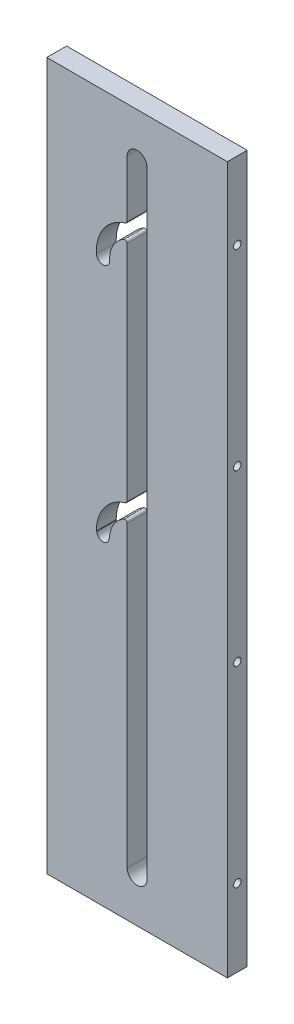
ISO-10303-21;
HEADER;
FILE_DESCRIPTION(('STEP AP214'),'2;1');
FILE_NAME('part.step','',(''),(''),'','','');
FILE_SCHEMA(('AUTOMOTIVE_DESIGN { 1 0 10303 214 1 1 1 1 }'));
ENDSEC;
DATA;
#1=APPLICATION_CONTEXT('core data for automotive mechanical design processes');
#2=APPLICATION_PROTOCOL_DEFINITION('international standard','automotive_design',2000,#1);
#3=PRODUCT_CONTEXT('',#1,'mechanical');
#4=PRODUCT('Part','Part','',(#3));
#5=PRODUCT_RELATED_PRODUCT_CATEGORY('part','',(#4));
#6=PRODUCT_DEFINITION_FORMATION('','',#4);
#7=PRODUCT_DEFINITION_CONTEXT('part definition',#1,'design');
#8=PRODUCT_DEFINITION('design','',#6,#7);
#9=PRODUCT_DEFINITION_SHAPE('','',#8);
#10=(LENGTH_UNIT() NAMED_UNIT(*) SI_UNIT(.MILLI.,.METRE.));
#11=(NAMED_UNIT(*) PLANE_ANGLE_UNIT() SI_UNIT($,.RADIAN.));
#12=(NAMED_UNIT(*) SI_UNIT($,.STERADIAN.) SOLID_ANGLE_UNIT());
#13=UNCERTAINTY_MEASURE_WITH_UNIT(LENGTH_MEASURE(1.E-05),#10,'distance_accuracy_value','');
#14=(GEOMETRIC_REPRESENTATION_CONTEXT(3) GLOBAL_UNCERTAINTY_ASSIGNED_CONTEXT((#13)) GLOBAL_UNIT_ASSIGNED_CONTEXT((#10,
#11,#12)) REPRESENTATION_CONTEXT('',''));
#15=CARTESIAN_POINT('',(0.,0.,0.));
#16=DIRECTION('',(0.,0.,1.));
#17=DIRECTION('',(1.,0.,0.));
#18=AXIS2_PLACEMENT_3D('',#15,#16,#17);
#19=CARTESIAN_POINT('',(-89.4999999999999,29.5,150.));
#20=DIRECTION('',(-1.,0.,0.));
#21=DIRECTION('',(0.,1.,0.));
#22=AXIS2_PLACEMENT_3D('',#19,#20,#21);
#23=PLANE('',#22);
#24=DIRECTION('',(0.,1.,0.));
#25=VECTOR('',#24,1.);
#26=CARTESIAN_POINT('',(-89.4999999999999,29.5,150.));
#27=LINE('',#26,#25);
#28=CARTESIAN_POINT('',(-89.4999999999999,283.70828693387,150.));
#29=VERTEX_POINT('',#28);
#30=CARTESIAN_POINT('',(-89.4999999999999,309.5,150.));
#31=VERTEX_POINT('',#30);
#32=EDGE_CURVE('E274',#29,#31,#27,.T.);
#33=ORIENTED_EDGE('',*,*,#32,.F.);
#34=DIRECTION('',(0.,0.,1.));
#35=VECTOR('',#34,1.);
#36=CARTESIAN_POINT('',(-89.4999999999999,283.70828693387,141.));
#37=LINE('',#36,#35);
#38=CARTESIAN_POINT('',(-89.4999999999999,283.70828693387,141.));
#39=VERTEX_POINT('',#38);
#40=EDGE_CURVE('E12',#29,#39,#37,.F.);
#41=ORIENTED_EDGE('',*,*,#40,.T.);
#42=DIRECTION('',(0.,1.,0.));
#43=VECTOR('',#42,1.);
#44=CARTESIAN_POINT('',(-89.5,29.5,141.));
#45=LINE('',#44,#43);
#46=CARTESIAN_POINT('',(-89.4999999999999,309.5,141.));
#47=VERTEX_POINT('',#46);
#48=EDGE_CURVE('E260',#39,#47,#45,.T.);
#49=ORIENTED_EDGE('',*,*,#48,.T.);
#50=DIRECTION('',(0.,0.,-1.));
#51=VECTOR('',#50,1.);
#52=CARTESIAN_POINT('',(-89.4999999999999,309.5,150.));
#53=LINE('',#52,#51);
#54=EDGE_CURVE('E240',#31,#47,#53,.T.);
#55=ORIENTED_EDGE('',*,*,#54,.F.);
#56=EDGE_LOOP('',(#33,#41,#49,#55));
#57=FACE_BOUND('',#56,.T.);
#58=ADVANCED_FACE('F37',(#57),#23,.F.);
#59=CARTESIAN_POINT('',(-103.5,155.,150.));
#60=DIRECTION('',(0.,1.,0.));
#61=DIRECTION('',(0.,0.,-1.));
#62=AXIS2_PLACEMENT_3D('',#59,#60,#61);
#63=PLANE('',#62);
#64=DIRECTION('',(1.,0.,0.));
#65=VECTOR('',#64,1.);
#66=CARTESIAN_POINT('',(-103.5,155.,141.));
#67=LINE('',#66,#65);
#68=CARTESIAN_POINT('',(-97.7499999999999,155.,141.));
#69=VERTEX_POINT('',#68);
#70=CARTESIAN_POINT('',(-97.5,155.,141.));
#71=VERTEX_POINT('',#70);
#72=EDGE_CURVE('E290',#69,#71,#67,.T.);
#73=ORIENTED_EDGE('',*,*,#72,.F.);
#74=DIRECTION('',(0.,0.,-1.));
#75=VECTOR('',#74,1.);
#76=CARTESIAN_POINT('',(-97.7499999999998,155.,150.));
#77=LINE('',#76,#75);
#78=CARTESIAN_POINT('',(-97.7499999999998,155.,150.));
#79=VERTEX_POINT('',#78);
#80=EDGE_CURVE('E194',#69,#79,#77,.F.);
#81=ORIENTED_EDGE('',*,*,#80,.T.);
#82=DIRECTION('',(1.,0.,0.));
#83=VECTOR('',#82,1.);
#84=CARTESIAN_POINT('',(-103.5,155.,150.));
#85=LINE('',#84,#83);
#86=CARTESIAN_POINT('',(-97.4999999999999,155.,150.));
#87=VERTEX_POINT('',#86);
#88=EDGE_CURVE('E300',#79,#87,#85,.T.);
#89=ORIENTED_EDGE('',*,*,#88,.T.);
#90=DIRECTION('',(0.,0.,-1.));
#91=VECTOR('',#90,1.);
#92=CARTESIAN_POINT('',(-97.4999999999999,155.,150.));
#93=LINE('',#92,#91);
#94=EDGE_CURVE('E277',#87,#71,#93,.T.);
#95=ORIENTED_EDGE('',*,*,#94,.T.);
#96=EDGE_LOOP('',(#73,#81,#89,#95));
#97=FACE_BOUND('',#96,.T.);
#98=ADVANCED_FACE('F484',(#97),#63,.T.);
#99=CARTESIAN_POINT('',(-103.5,155.,150.));
#100=VERTEX_POINT('',#99);
#101=CARTESIAN_POINT('',(-103.25,155.,150.));
#102=VERTEX_POINT('',#101);
#103=EDGE_CURVE('E297',#100,#102,#85,.T.);
#104=ORIENTED_EDGE('',*,*,#103,.T.);
#105=DIRECTION('',(0.,0.,-1.));
#106=VECTOR('',#105,1.);
#107=CARTESIAN_POINT('',(-103.25,155.,150.));
#108=LINE('',#107,#106);
#109=CARTESIAN_POINT('',(-103.25,155.,141.));
#110=VERTEX_POINT('',#109);
#111=EDGE_CURVE('E197',#102,#110,#108,.T.);
#112=ORIENTED_EDGE('',*,*,#111,.T.);
#113=CARTESIAN_POINT('',(-103.5,155.,141.));
#114=VERTEX_POINT('',#113);
#115=EDGE_CURVE('E287',#114,#110,#67,.T.);
#116=ORIENTED_EDGE('',*,*,#115,.F.);
#117=DIRECTION('',(0.,0.,-1.));
#118=VECTOR('',#117,1.);
#119=CARTESIAN_POINT('',(-103.5,155.,150.));
#120=LINE('',#119,#118);
#121=EDGE_CURVE('E264',#100,#114,#120,.T.);
#122=ORIENTED_EDGE('',*,*,#121,.F.);
#123=EDGE_LOOP('',(#104,#112,#116,#122));
#124=FACE_BOUND('',#123,.T.);
#125=ADVANCED_FACE('F472',(#124),#63,.T.);
#126=CARTESIAN_POINT('',(-89.5,173.70828693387,141.));
#127=VERTEX_POINT('',#126);
#128=CARTESIAN_POINT('',(-89.4999999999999,275.099504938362,141.));
#129=VERTEX_POINT('',#128);
#130=EDGE_CURVE('E259',#127,#129,#45,.T.);
#131=ORIENTED_EDGE('',*,*,#130,.T.);
#132=DIRECTION('',(0.,0.,-1.));
#133=VECTOR('',#132,1.);
#134=CARTESIAN_POINT('',(-89.4999999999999,275.099504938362,150.));
#135=LINE('',#134,#133);
#136=CARTESIAN_POINT('',(-89.4999999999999,275.099504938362,150.));
#137=VERTEX_POINT('',#136);
#138=EDGE_CURVE('E161',#129,#137,#135,.F.);
#139=ORIENTED_EDGE('',*,*,#138,.T.);
#140=CARTESIAN_POINT('',(-89.4999999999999,173.70828693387,150.));
#141=VERTEX_POINT('',#140);
#142=EDGE_CURVE('E273',#141,#137,#27,.T.);
#143=ORIENTED_EDGE('',*,*,#142,.F.);
#144=DIRECTION('',(0.,0.,1.));
#145=VECTOR('',#144,1.);
#146=CARTESIAN_POINT('',(-89.5,173.70828693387,141.));
#147=LINE('',#146,#145);
#148=EDGE_CURVE('E182',#141,#127,#147,.F.);
#149=ORIENTED_EDGE('',*,*,#148,.T.);
#150=EDGE_LOOP('',(#131,#139,#143,#149));
#151=FACE_BOUND('',#150,.T.);
#152=ADVANCED_FACE('F365',(#151),#23,.F.);
#153=CARTESIAN_POINT('',(-43.9999999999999,9.,150.));
#154=DIRECTION('',(1.,0.,0.));
#155=DIRECTION('',(0.,0.,-1.));
#156=AXIS2_PLACEMENT_3D('',#153,#154,#155);
#157=PLANE('',#156);
#158=CARTESIAN_POINT('',(-44.,295.,145.5));
#159=DIRECTION('',(1.,0.,0.));
#160=DIRECTION('',(0.,0.,-1.));
#161=AXIS2_PLACEMENT_3D('',#158,#159,#160);
#162=CIRCLE('',#161,1.69999999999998);
#163=CARTESIAN_POINT('',(-44.,295.,143.8));
#164=VERTEX_POINT('',#163);
#165=EDGE_CURVE('E94',#164,#164,#162,.T.);
#166=ORIENTED_EDGE('',*,*,#165,.F.);
#167=EDGE_LOOP('',(#166));
#168=FACE_BOUND('',#167,.T.);
#169=CARTESIAN_POINT('',(-44.,208.,145.5));
#170=DIRECTION('',(1.,0.,0.));
#171=DIRECTION('',(0.,0.,-1.));
#172=AXIS2_PLACEMENT_3D('',#169,#170,#171);
#173=CIRCLE('',#172,1.70000000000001);
#174=CARTESIAN_POINT('',(-44.,208.,143.8));
#175=VERTEX_POINT('',#174);
#176=EDGE_CURVE('E93',#175,#175,#173,.T.);
#177=ORIENTED_EDGE('',*,*,#176,.F.);
#178=EDGE_LOOP('',(#177));
#179=FACE_BOUND('',#178,.T.);
#180=CARTESIAN_POINT('',(-44.,131.,145.5));
#181=DIRECTION('',(1.,0.,0.));
#182=DIRECTION('',(0.,0.,-1.));
#183=AXIS2_PLACEMENT_3D('',#180,#181,#182);
#184=CIRCLE('',#183,1.69999999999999);
#185=CARTESIAN_POINT('',(-44.,131.,143.8));
#186=VERTEX_POINT('',#185);
#187=EDGE_CURVE('E126',#186,#186,#184,.T.);
#188=ORIENTED_EDGE('',*,*,#187,.F.);
#189=EDGE_LOOP('',(#188));
#190=FACE_BOUND('',#189,.T.);
#191=CARTESIAN_POINT('',(-44.,44.,145.5));
#192=DIRECTION('',(1.,0.,0.));
#193=DIRECTION('',(0.,0.,-1.));
#194=AXIS2_PLACEMENT_3D('',#191,#192,#193);
#195=CIRCLE('',#194,1.69999999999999);
#196=CARTESIAN_POINT('',(-44.,44.,143.8));
#197=VERTEX_POINT('',#196);
#198=EDGE_CURVE('E125',#197,#197,#195,.T.);
#199=ORIENTED_EDGE('',*,*,#198,.F.);
#200=EDGE_LOOP('',(#199));
#201=FACE_BOUND('',#200,.T.);
#202=DIRECTION('',(0.,-1.,0.));
#203=VECTOR('',#202,1.);
#204=CARTESIAN_POINT('',(-44.,9.,141.));
#205=LINE('',#204,#203);
#206=CARTESIAN_POINT('',(-44.,330.,141.));
#207=VERTEX_POINT('',#206);
#208=CARTESIAN_POINT('',(-44.,9.,141.));
#209=VERTEX_POINT('',#208);
#210=EDGE_CURVE('E223',#207,#209,#205,.T.);
#211=ORIENTED_EDGE('',*,*,#210,.F.);
#212=DIRECTION('',(0.,0.,-1.));
#213=VECTOR('',#212,1.);
#214=CARTESIAN_POINT('',(-43.9999999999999,330.,150.));
#215=LINE('',#214,#213);
#216=CARTESIAN_POINT('',(-43.9999999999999,330.,150.));
#217=VERTEX_POINT('',#216);
#218=EDGE_CURVE('E200',#217,#207,#215,.T.);
#219=ORIENTED_EDGE('',*,*,#218,.F.);
#220=DIRECTION('',(0.,-1.,0.));
#221=VECTOR('',#220,1.);
#222=CARTESIAN_POINT('',(-43.9999999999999,9.,150.));
#223=LINE('',#222,#221);
#224=CARTESIAN_POINT('',(-43.9999999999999,9.,150.));
#225=VERTEX_POINT('',#224);
#226=EDGE_CURVE('E216',#217,#225,#223,.T.);
#227=ORIENTED_EDGE('',*,*,#226,.T.);
#228=DIRECTION('',(0.,0.,-1.));
#229=VECTOR('',#228,1.);
#230=CARTESIAN_POINT('',(-43.9999999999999,9.,150.));
#231=LINE('',#230,#229);
#232=EDGE_CURVE('E201',#225,#209,#231,.T.);
#233=ORIENTED_EDGE('',*,*,#232,.T.);
#234=EDGE_LOOP('',(#211,#219,#227,#233));
#235=FACE_BOUND('',#234,.T.);
#236=ADVANCED_FACE('F521',(#168,#179,#190,#201,#235),#157,.T.);
#237=CARTESIAN_POINT('',(-43.9999999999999,330.,150.));
#238=DIRECTION('',(0.,1.,0.));
#239=DIRECTION('',(0.,0.,-1.));
#240=AXIS2_PLACEMENT_3D('',#237,#238,#239);
#241=PLANE('',#240);
#242=DIRECTION('',(1.,0.,0.));
#243=VECTOR('',#242,1.);
#244=CARTESIAN_POINT('',(-44.,330.,141.));
#245=LINE('',#244,#243);
#246=CARTESIAN_POINT('',(-126.,330.,141.));
#247=VERTEX_POINT('',#246);
#248=EDGE_CURVE('E213',#247,#207,#245,.T.);
#249=ORIENTED_EDGE('',*,*,#248,.F.);
#250=DIRECTION('',(0.,0.,-1.));
#251=VECTOR('',#250,1.);
#252=CARTESIAN_POINT('',(-126.,330.,150.));
#253=LINE('',#252,#251);
#254=CARTESIAN_POINT('',(-126.,330.,150.));
#255=VERTEX_POINT('',#254);
#256=EDGE_CURVE('E208',#255,#247,#253,.T.);
#257=ORIENTED_EDGE('',*,*,#256,.F.);
#258=DIRECTION('',(1.,0.,0.));
#259=VECTOR('',#258,1.);
#260=CARTESIAN_POINT('',(-43.9999999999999,330.,150.));
#261=LINE('',#260,#259);
#262=EDGE_CURVE('E205',#255,#217,#261,.T.);
#263=ORIENTED_EDGE('',*,*,#262,.T.);
#264=ORIENTED_EDGE('',*,*,#218,.T.);
#265=EDGE_LOOP('',(#249,#257,#263,#264));
#266=FACE_BOUND('',#265,.T.);
#267=ADVANCED_FACE('F585',(#266),#241,.T.);
#268=CARTESIAN_POINT('',(-126.,9.,150.));
#269=DIRECTION('',(-1.,0.,0.));
#270=DIRECTION('',(0.,0.,1.));
#271=AXIS2_PLACEMENT_3D('',#268,#269,#270);
#272=PLANE('',#271);
#273=CARTESIAN_POINT('',(-126.,295.,145.5));
#274=DIRECTION('',(-1.,0.,0.));
#275=DIRECTION('',(0.,0.,1.));
#276=AXIS2_PLACEMENT_3D('',#273,#274,#275);
#277=CIRCLE('',#276,1.69999999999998);
#278=CARTESIAN_POINT('',(-126.,295.,147.2));
#279=VERTEX_POINT('',#278);
#280=EDGE_CURVE('E119',#279,#279,#277,.T.);
#281=ORIENTED_EDGE('',*,*,#280,.F.);
#282=EDGE_LOOP('',(#281));
#283=FACE_BOUND('',#282,.T.);
#284=CARTESIAN_POINT('',(-126.,208.,145.5));
#285=DIRECTION('',(-1.,0.,0.));
#286=DIRECTION('',(0.,0.,1.));
#287=AXIS2_PLACEMENT_3D('',#284,#285,#286);
#288=CIRCLE('',#287,1.70000000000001);
#289=CARTESIAN_POINT('',(-126.,208.,147.2));
#290=VERTEX_POINT('',#289);
#291=EDGE_CURVE('E115',#290,#290,#288,.T.);
#292=ORIENTED_EDGE('',*,*,#291,.F.);
#293=EDGE_LOOP('',(#292));
#294=FACE_BOUND('',#293,.T.);
#295=CARTESIAN_POINT('',(-126.,131.,145.5));
#296=DIRECTION('',(-1.,0.,0.));
#297=DIRECTION('',(0.,0.,1.));
#298=AXIS2_PLACEMENT_3D('',#295,#296,#297);
#299=CIRCLE('',#298,1.69999999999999);
#300=CARTESIAN_POINT('',(-126.,131.,147.2));
#301=VERTEX_POINT('',#300);
#302=EDGE_CURVE('E111',#301,#301,#299,.T.);
#303=ORIENTED_EDGE('',*,*,#302,.F.);
#304=EDGE_LOOP('',(#303));
#305=FACE_BOUND('',#304,.T.);
#306=CARTESIAN_POINT('',(-126.,44.,145.5));
#307=DIRECTION('',(-1.,0.,0.));
#308=DIRECTION('',(0.,0.,1.));
#309=AXIS2_PLACEMENT_3D('',#306,#307,#308);
#310=CIRCLE('',#309,1.69999999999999);
#311=CARTESIAN_POINT('',(-126.,44.,147.2));
#312=VERTEX_POINT('',#311);
#313=EDGE_CURVE('E104',#312,#312,#310,.T.);
#314=ORIENTED_EDGE('',*,*,#313,.F.);
#315=EDGE_LOOP('',(#314));
#316=FACE_BOUND('',#315,.T.);
#317=DIRECTION('',(0.,1.,0.));
#318=VECTOR('',#317,1.);
#319=CARTESIAN_POINT('',(-126.,9.,141.));
#320=LINE('',#319,#318);
#321=CARTESIAN_POINT('',(-126.,9.,141.));
#322=VERTEX_POINT('',#321);
#323=EDGE_CURVE('E217',#322,#247,#320,.T.);
#324=ORIENTED_EDGE('',*,*,#323,.F.);
#325=DIRECTION('',(0.,0.,-1.));
#326=VECTOR('',#325,1.);
#327=CARTESIAN_POINT('',(-126.,9.,150.));
#328=LINE('',#327,#326);
#329=CARTESIAN_POINT('',(-126.,9.,150.));
#330=VERTEX_POINT('',#329);
#331=EDGE_CURVE('E204',#330,#322,#328,.T.);
#332=ORIENTED_EDGE('',*,*,#331,.F.);
#333=DIRECTION('',(0.,1.,0.));
#334=VECTOR('',#333,1.);
#335=CARTESIAN_POINT('',(-126.,9.,150.));
#336=LINE('',#335,#334);
#337=EDGE_CURVE('E229',#330,#255,#336,.T.);
#338=ORIENTED_EDGE('',*,*,#337,.T.);
#339=ORIENTED_EDGE('',*,*,#256,.T.);
#340=EDGE_LOOP('',(#324,#332,#338,#339));
#341=FACE_BOUND('',#340,.T.);
#342=ADVANCED_FACE('F581',(#283,#294,#305,#316,#341),#272,.T.);
#343=CARTESIAN_POINT('',(-43.9999999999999,9.,150.));
#344=DIRECTION('',(0.,-1.,0.));
#345=DIRECTION('',(0.,0.,1.));
#346=AXIS2_PLACEMENT_3D('',#343,#344,#345);
#347=PLANE('',#346);
#348=DIRECTION('',(-1.,0.,0.));
#349=VECTOR('',#348,1.);
#350=CARTESIAN_POINT('',(-44.,9.,141.));
#351=LINE('',#350,#349);
#352=EDGE_CURVE('E220',#209,#322,#351,.T.);
#353=ORIENTED_EDGE('',*,*,#352,.F.);
#354=ORIENTED_EDGE('',*,*,#232,.F.);
#355=DIRECTION('',(-1.,0.,0.));
#356=VECTOR('',#355,1.);
#357=CARTESIAN_POINT('',(-43.9999999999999,9.,150.));
#358=LINE('',#357,#356);
#359=EDGE_CURVE('E232',#225,#330,#358,.T.);
#360=ORIENTED_EDGE('',*,*,#359,.T.);
#361=ORIENTED_EDGE('',*,*,#331,.T.);
#362=EDGE_LOOP('',(#353,#354,#360,#361));
#363=FACE_BOUND('',#362,.T.);
#364=ADVANCED_FACE('F584',(#363),#347,.T.);
#365=CARTESIAN_POINT('',(-170.,0.,150.000000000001));
#366=DIRECTION('',(0.,0.,1.));
#367=DIRECTION('',(1.,0.,0.));
#368=AXIS2_PLACEMENT_3D('',#365,#366,#367);
#369=PLANE('',#368);
#370=ORIENTED_EDGE('',*,*,#142,.T.);
#371=CARTESIAN_POINT('',(-90.4999999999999,275.099504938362,150.));
#372=DIRECTION('',(0.,0.,1.));
#373=DIRECTION('',(1.,0.,0.));
#374=AXIS2_PLACEMENT_3D('',#371,#372,#373);
#375=CIRCLE('',#374,1.);
#376=CARTESIAN_POINT('',(-90.9782608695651,275.977722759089,150.));
#377=VERTEX_POINT('',#376);
#378=EDGE_CURVE('E155',#137,#377,#375,.T.);
#379=ORIENTED_EDGE('',*,*,#378,.T.);
#380=CARTESIAN_POINT('',(-84.9999999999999,265.,150.));
#381=DIRECTION('',(0.,0.,-1.));
#382=DIRECTION('',(-1.,0.,0.));
#383=AXIS2_PLACEMENT_3D('',#380,#381,#382);
#384=CIRCLE('',#383,12.5);
#385=CARTESIAN_POINT('',(-97.4857501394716,264.403306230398,150.));
#386=VERTEX_POINT('',#385);
#387=EDGE_CURVE('E317',#377,#386,#384,.F.);
#388=ORIENTED_EDGE('',*,*,#387,.T.);
#389=CARTESIAN_POINT('',(-100.482330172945,264.260099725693,150.));
#390=DIRECTION('',(0.,0.,-1.));
#391=DIRECTION('',(-1.,0.,0.));
#392=AXIS2_PLACEMENT_3D('',#389,#390,#391);
#393=CIRCLE('',#392,2.99999999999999);
#394=CARTESIAN_POINT('',(-103.478910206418,264.116893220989,150.));
#395=VERTEX_POINT('',#394);
#396=EDGE_CURVE('E320',#386,#395,#393,.T.);
#397=ORIENTED_EDGE('',*,*,#396,.T.);
#398=CARTESIAN_POINT('',(-84.9999999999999,265.,150.));
#399=DIRECTION('',(0.,0.,-1.));
#400=DIRECTION('',(-1.,0.,0.));
#401=AXIS2_PLACEMENT_3D('',#398,#399,#400);
#402=CIRCLE('',#401,18.5);
#403=CARTESIAN_POINT('',(-90.2179487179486,282.748887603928,150.));
#404=VERTEX_POINT('',#403);
#405=EDGE_CURVE('E312',#404,#395,#402,.F.);
#406=ORIENTED_EDGE('',*,*,#405,.F.);
#407=CARTESIAN_POINT('',(-90.4999999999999,283.70828693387,150.));
#408=DIRECTION('',(0.,0.,1.));
#409=DIRECTION('',(1.,0.,0.));
#410=AXIS2_PLACEMENT_3D('',#407,#408,#409);
#411=CIRCLE('',#410,1.);
#412=EDGE_CURVE('E158',#404,#29,#411,.T.);
#413=ORIENTED_EDGE('',*,*,#412,.T.);
#414=ORIENTED_EDGE('',*,*,#32,.T.);
#415=CARTESIAN_POINT('',(-84.9999999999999,309.5,150.));
#416=DIRECTION('',(0.,0.,-1.));
#417=DIRECTION('',(-1.,0.,0.));
#418=AXIS2_PLACEMENT_3D('',#415,#416,#417);
#419=CIRCLE('',#418,4.5);
#420=CARTESIAN_POINT('',(-80.4999999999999,309.5,150.));
#421=VERTEX_POINT('',#420);
#422=EDGE_CURVE('E267',#31,#421,#419,.T.);
#423=ORIENTED_EDGE('',*,*,#422,.T.);
#424=DIRECTION('',(0.,1.,0.));
#425=VECTOR('',#424,1.);
#426=CARTESIAN_POINT('',(-80.4999999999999,29.5,150.));
#427=LINE('',#426,#425);
#428=CARTESIAN_POINT('',(-80.4999999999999,29.5,150.));
#429=VERTEX_POINT('',#428);
#430=EDGE_CURVE('E241',#429,#421,#427,.T.);
#431=ORIENTED_EDGE('',*,*,#430,.F.);
#432=CARTESIAN_POINT('',(-84.9999999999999,29.5,150.));
#433=DIRECTION('',(0.,0.,-1.));
#434=DIRECTION('',(-1.,0.,0.));
#435=AXIS2_PLACEMENT_3D('',#432,#433,#434);
#436=CIRCLE('',#435,4.5);
#437=CARTESIAN_POINT('',(-89.4999999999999,29.5,150.));
#438=VERTEX_POINT('',#437);
#439=EDGE_CURVE('E252',#429,#438,#436,.T.);
#440=ORIENTED_EDGE('',*,*,#439,.T.);
#441=CARTESIAN_POINT('',(-89.4999999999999,165.099504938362,150.));
#442=VERTEX_POINT('',#441);
#443=EDGE_CURVE('E270',#438,#442,#27,.T.);
#444=ORIENTED_EDGE('',*,*,#443,.T.);
#445=CARTESIAN_POINT('',(-90.4999999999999,165.099504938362,150.));
#446=DIRECTION('',(0.,0.,1.));
#447=DIRECTION('',(1.,0.,0.));
#448=AXIS2_PLACEMENT_3D('',#445,#446,#447);
#449=CIRCLE('',#448,1.);
#450=CARTESIAN_POINT('',(-90.9782608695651,165.977722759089,150.));
#451=VERTEX_POINT('',#450);
#452=EDGE_CURVE('E188',#442,#451,#449,.T.);
#453=ORIENTED_EDGE('',*,*,#452,.T.);
#454=CARTESIAN_POINT('',(-84.9999999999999,155.,150.));
#455=DIRECTION('',(0.,0.,-1.));
#456=DIRECTION('',(-1.,0.,0.));
#457=AXIS2_PLACEMENT_3D('',#454,#455,#456);
#458=CIRCLE('',#457,12.5);
#459=EDGE_CURVE('E286',#451,#87,#458,.F.);
#460=ORIENTED_EDGE('',*,*,#459,.T.);
#461=ORIENTED_EDGE('',*,*,#88,.F.);
#462=CARTESIAN_POINT('',(-100.5,155.000000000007,150.));
#463=DIRECTION('',(0.,0.,1.));
#464=DIRECTION('',(4.56530646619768E-13,1.,0.));
#465=AXIS2_PLACEMENT_3D('',#462,#463,#464);
#466=CIRCLE('',#465,2.75000000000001);
#467=EDGE_CURVE('E305',#102,#79,#466,.T.);
#468=ORIENTED_EDGE('',*,*,#467,.F.);
#469=ORIENTED_EDGE('',*,*,#103,.F.);
#470=CARTESIAN_POINT('',(-84.9999999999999,155.,150.));
#471=DIRECTION('',(0.,0.,-1.));
#472=DIRECTION('',(-1.,0.,0.));
#473=AXIS2_PLACEMENT_3D('',#470,#471,#472);
#474=CIRCLE('',#473,18.5);
#475=CARTESIAN_POINT('',(-90.2179487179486,172.748887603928,150.));
#476=VERTEX_POINT('',#475);
#477=EDGE_CURVE('E280',#476,#100,#474,.F.);
#478=ORIENTED_EDGE('',*,*,#477,.F.);
#479=CARTESIAN_POINT('',(-90.4999999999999,173.70828693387,150.));
#480=DIRECTION('',(0.,0.,1.));
#481=DIRECTION('',(1.,0.,0.));
#482=AXIS2_PLACEMENT_3D('',#479,#480,#481);
#483=CIRCLE('',#482,1.);
#484=EDGE_CURVE('E185',#476,#141,#483,.T.);
#485=ORIENTED_EDGE('',*,*,#484,.T.);
#486=EDGE_LOOP('',(#370,#379,#388,#397,#406,#413,#414,#423,#431,#440,#444,#453,#460,#461,#468,
#469,#478,#485));
#487=FACE_BOUND('',#486,.T.);
#488=ORIENTED_EDGE('',*,*,#226,.F.);
#489=ORIENTED_EDGE('',*,*,#262,.F.);
#490=ORIENTED_EDGE('',*,*,#337,.F.);
#491=ORIENTED_EDGE('',*,*,#359,.F.);
#492=EDGE_LOOP('',(#488,#489,#490,#491));
#493=FACE_BOUND('',#492,.T.);
#494=ADVANCED_FACE('F329',(#487,#493),#369,.T.);
#495=CARTESIAN_POINT('',(-170.,0.,141.000000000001));
#496=DIRECTION('',(0.,0.,1.));
#497=DIRECTION('',(1.,0.,0.));
#498=AXIS2_PLACEMENT_3D('',#495,#496,#497);
#499=PLANE('',#498);
#500=CARTESIAN_POINT('',(-85.,265.,141.));
#501=DIRECTION('',(0.,0.,1.));
#502=DIRECTION('',(1.,0.,0.));
#503=AXIS2_PLACEMENT_3D('',#500,#501,#502);
#504=CIRCLE('',#503,12.5);
#505=CARTESIAN_POINT('',(-97.4857501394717,264.403306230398,141.));
#506=VERTEX_POINT('',#505);
#507=CARTESIAN_POINT('',(-90.9782608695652,275.977722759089,141.));
#508=VERTEX_POINT('',#507);
#509=EDGE_CURVE('E164',#506,#508,#504,.F.);
#510=ORIENTED_EDGE('',*,*,#509,.T.);
#511=CARTESIAN_POINT('',(-90.4999999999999,275.099504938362,141.));
#512=DIRECTION('',(0.,0.,1.));
#513=DIRECTION('',(1.,0.,0.));
#514=AXIS2_PLACEMENT_3D('',#511,#512,#513);
#515=CIRCLE('',#514,1.);
#516=EDGE_CURVE('E147',#508,#129,#515,.F.);
#517=ORIENTED_EDGE('',*,*,#516,.T.);
#518=ORIENTED_EDGE('',*,*,#130,.F.);
#519=CARTESIAN_POINT('',(-90.5,173.70828693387,141.));
#520=DIRECTION('',(0.,0.,1.));
#521=DIRECTION('',(1.,0.,0.));
#522=AXIS2_PLACEMENT_3D('',#519,#520,#521);
#523=CIRCLE('',#522,1.);
#524=CARTESIAN_POINT('',(-90.2179487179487,172.748887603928,141.));
#525=VERTEX_POINT('',#524);
#526=EDGE_CURVE('E176',#127,#525,#523,.F.);
#527=ORIENTED_EDGE('',*,*,#526,.T.);
#528=CARTESIAN_POINT('',(-85.,155.,141.));
#529=DIRECTION('',(0.,0.,-1.));
#530=DIRECTION('',(-1.,0.,0.));
#531=AXIS2_PLACEMENT_3D('',#528,#529,#530);
#532=CIRCLE('',#531,18.5);
#533=EDGE_CURVE('E283',#525,#114,#532,.F.);
#534=ORIENTED_EDGE('',*,*,#533,.T.);
#535=ORIENTED_EDGE('',*,*,#115,.T.);
#536=CARTESIAN_POINT('',(-100.5,155.000000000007,141.));
#537=DIRECTION('',(0.,0.,-1.));
#538=DIRECTION('',(-1.,0.,0.));
#539=AXIS2_PLACEMENT_3D('',#536,#537,#538);
#540=CIRCLE('',#539,2.75000000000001);
#541=EDGE_CURVE('E294',#110,#69,#540,.F.);
#542=ORIENTED_EDGE('',*,*,#541,.T.);
#543=ORIENTED_EDGE('',*,*,#72,.T.);
#544=CARTESIAN_POINT('',(-85.,155.,141.));
#545=DIRECTION('',(0.,0.,-1.));
#546=DIRECTION('',(-1.,0.,0.));
#547=AXIS2_PLACEMENT_3D('',#544,#545,#546);
#548=CIRCLE('',#547,12.5);
#549=CARTESIAN_POINT('',(-90.9782608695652,165.977722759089,141.));
#550=VERTEX_POINT('',#549);
#551=EDGE_CURVE('E291',#550,#71,#548,.F.);
#552=ORIENTED_EDGE('',*,*,#551,.F.);
#553=CARTESIAN_POINT('',(-90.5,165.099504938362,141.));
#554=DIRECTION('',(0.,0.,1.));
#555=DIRECTION('',(1.,0.,0.));
#556=AXIS2_PLACEMENT_3D('',#553,#554,#555);
#557=CIRCLE('',#556,1.);
#558=CARTESIAN_POINT('',(-89.5,165.099504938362,141.));
#559=VERTEX_POINT('',#558);
#560=EDGE_CURVE('E179',#550,#559,#557,.F.);
#561=ORIENTED_EDGE('',*,*,#560,.T.);
#562=CARTESIAN_POINT('',(-89.5,29.5,141.));
#563=VERTEX_POINT('',#562);
#564=EDGE_CURVE('E256',#563,#559,#45,.T.);
#565=ORIENTED_EDGE('',*,*,#564,.F.);
#566=CARTESIAN_POINT('',(-85.,29.5,141.));
#567=DIRECTION('',(0.,0.,-1.));
#568=DIRECTION('',(-1.,0.,0.));
#569=AXIS2_PLACEMENT_3D('',#566,#567,#568);
#570=CIRCLE('',#569,4.5);
#571=CARTESIAN_POINT('',(-80.5,29.5,141.));
#572=VERTEX_POINT('',#571);
#573=EDGE_CURVE('E261',#572,#563,#570,.T.);
#574=ORIENTED_EDGE('',*,*,#573,.F.);
#575=DIRECTION('',(0.,1.,0.));
#576=VECTOR('',#575,1.);
#577=CARTESIAN_POINT('',(-80.5,29.5,141.));
#578=LINE('',#577,#576);
#579=CARTESIAN_POINT('',(-80.4999999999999,309.5,141.));
#580=VERTEX_POINT('',#579);
#581=EDGE_CURVE('E249',#572,#580,#578,.T.);
#582=ORIENTED_EDGE('',*,*,#581,.T.);
#583=CARTESIAN_POINT('',(-84.9999999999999,309.5,141.));
#584=DIRECTION('',(0.,0.,-1.));
#585=DIRECTION('',(-1.,0.,0.));
#586=AXIS2_PLACEMENT_3D('',#583,#584,#585);
#587=CIRCLE('',#586,4.5);
#588=EDGE_CURVE('E253',#47,#580,#587,.T.);
#589=ORIENTED_EDGE('',*,*,#588,.F.);
#590=ORIENTED_EDGE('',*,*,#48,.F.);
#591=CARTESIAN_POINT('',(-90.4999999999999,283.70828693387,141.));
#592=DIRECTION('',(0.,0.,1.));
#593=DIRECTION('',(1.,0.,0.));
#594=AXIS2_PLACEMENT_3D('',#591,#592,#593);
#595=CIRCLE('',#594,1.);
#596=CARTESIAN_POINT('',(-90.2179487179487,282.748887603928,141.));
#597=VERTEX_POINT('',#596);
#598=EDGE_CURVE('E150',#39,#597,#595,.F.);
#599=ORIENTED_EDGE('',*,*,#598,.T.);
#600=CARTESIAN_POINT('',(-85.,265.,141.));
#601=DIRECTION('',(0.,0.,1.));
#602=DIRECTION('',(1.,0.,0.));
#603=AXIS2_PLACEMENT_3D('',#600,#601,#602);
#604=CIRCLE('',#603,18.5);
#605=CARTESIAN_POINT('',(-103.478910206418,264.116893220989,141.));
#606=VERTEX_POINT('',#605);
#607=EDGE_CURVE('E167',#606,#597,#604,.F.);
#608=ORIENTED_EDGE('',*,*,#607,.F.);
#609=CARTESIAN_POINT('',(-100.482330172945,264.260099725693,141.));
#610=DIRECTION('',(0.,0.,-1.));
#611=DIRECTION('',(-1.,0.,0.));
#612=AXIS2_PLACEMENT_3D('',#609,#610,#611);
#613=CIRCLE('',#612,2.99999999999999);
#614=EDGE_CURVE('E143',#506,#606,#613,.T.);
#615=ORIENTED_EDGE('',*,*,#614,.F.);
#616=EDGE_LOOP('',(#510,#517,#518,#527,#534,#535,#542,#543,#552,#561,#565,#574,#582,#589,#590,
#599,#608,#615));
#617=FACE_BOUND('',#616,.T.);
#618=ORIENTED_EDGE('',*,*,#210,.T.);
#619=ORIENTED_EDGE('',*,*,#352,.T.);
#620=ORIENTED_EDGE('',*,*,#323,.T.);
#621=ORIENTED_EDGE('',*,*,#248,.T.);
#622=EDGE_LOOP('',(#618,#619,#620,#621));
#623=FACE_BOUND('',#622,.T.);
#624=ADVANCED_FACE('F350',(#617,#623),#499,.F.);
#625=CARTESIAN_POINT('',(-84.9999999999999,29.5,150.));
#626=DIRECTION('',(0.,0.,-1.));
#627=DIRECTION('',(-1.,0.,0.));
#628=AXIS2_PLACEMENT_3D('',#625,#626,#627);
#629=CYLINDRICAL_SURFACE('',#628,4.5);
#630=ORIENTED_EDGE('',*,*,#573,.T.);
#631=DIRECTION('',(0.,0.,-1.));
#632=VECTOR('',#631,1.);
#633=CARTESIAN_POINT('',(-89.4999999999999,29.5,150.));
#634=LINE('',#633,#632);
#635=EDGE_CURVE('E237',#438,#563,#634,.T.);
#636=ORIENTED_EDGE('',*,*,#635,.F.);
#637=ORIENTED_EDGE('',*,*,#439,.F.);
#638=DIRECTION('',(0.,0.,-1.));
#639=VECTOR('',#638,1.);
#640=CARTESIAN_POINT('',(-80.4999999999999,29.5,150.));
#641=LINE('',#640,#639);
#642=EDGE_CURVE('E226',#429,#572,#641,.T.);
#643=ORIENTED_EDGE('',*,*,#642,.T.);
#644=EDGE_LOOP('',(#630,#636,#637,#643));
#645=FACE_BOUND('',#644,.T.);
#646=ADVANCED_FACE('F500',(#645),#629,.F.);
#647=CARTESIAN_POINT('',(-80.4999999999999,29.5,150.));
#648=DIRECTION('',(-1.,0.,0.));
#649=DIRECTION('',(0.,1.,0.));
#650=AXIS2_PLACEMENT_3D('',#647,#648,#649);
#651=PLANE('',#650);
#652=ORIENTED_EDGE('',*,*,#581,.F.);
#653=ORIENTED_EDGE('',*,*,#642,.F.);
#654=ORIENTED_EDGE('',*,*,#430,.T.);
#655=DIRECTION('',(0.,0.,-1.));
#656=VECTOR('',#655,1.);
#657=CARTESIAN_POINT('',(-80.4999999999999,309.5,150.));
#658=LINE('',#657,#656);
#659=EDGE_CURVE('E244',#421,#580,#658,.T.);
#660=ORIENTED_EDGE('',*,*,#659,.T.);
#661=EDGE_LOOP('',(#652,#653,#654,#660));
#662=FACE_BOUND('',#661,.T.);
#663=ADVANCED_FACE('F504',(#662),#651,.T.);
#664=CARTESIAN_POINT('',(-84.9999999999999,309.5,150.));
#665=DIRECTION('',(0.,0.,-1.));
#666=DIRECTION('',(-1.,0.,0.));
#667=AXIS2_PLACEMENT_3D('',#664,#665,#666);
#668=CYLINDRICAL_SURFACE('',#667,4.5);
#669=ORIENTED_EDGE('',*,*,#588,.T.);
#670=ORIENTED_EDGE('',*,*,#659,.F.);
#671=ORIENTED_EDGE('',*,*,#422,.F.);
#672=ORIENTED_EDGE('',*,*,#54,.T.);
#673=EDGE_LOOP('',(#669,#670,#671,#672));
#674=FACE_BOUND('',#673,.T.);
#675=ADVANCED_FACE('F384',(#674),#668,.F.);
#676=ORIENTED_EDGE('',*,*,#564,.T.);
#677=DIRECTION('',(0.,0.,-1.));
#678=VECTOR('',#677,1.);
#679=CARTESIAN_POINT('',(-89.4999999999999,165.099504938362,150.));
#680=LINE('',#679,#678);
#681=EDGE_CURVE('E173',#559,#442,#680,.F.);
#682=ORIENTED_EDGE('',*,*,#681,.T.);
#683=ORIENTED_EDGE('',*,*,#443,.F.);
#684=ORIENTED_EDGE('',*,*,#635,.T.);
#685=EDGE_LOOP('',(#676,#682,#683,#684));
#686=FACE_BOUND('',#685,.T.);
#687=ADVANCED_FACE('F497',(#686),#23,.F.);
#688=CARTESIAN_POINT('',(-84.9999999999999,155.,150.));
#689=DIRECTION('',(0.,0.,-1.));
#690=DIRECTION('',(-1.,0.,0.));
#691=AXIS2_PLACEMENT_3D('',#688,#689,#690);
#692=CYLINDRICAL_SURFACE('',#691,12.5);
#693=ORIENTED_EDGE('',*,*,#459,.F.);
#694=DIRECTION('',(0.,0.,-1.));
#695=VECTOR('',#694,1.);
#696=CARTESIAN_POINT('',(-90.9782608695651,165.977722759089,150.));
#697=LINE('',#696,#695);
#698=EDGE_CURVE('E170',#451,#550,#697,.T.);
#699=ORIENTED_EDGE('',*,*,#698,.T.);
#700=ORIENTED_EDGE('',*,*,#551,.T.);
#701=ORIENTED_EDGE('',*,*,#94,.F.);
#702=EDGE_LOOP('',(#693,#699,#700,#701));
#703=FACE_BOUND('',#702,.T.);
#704=ADVANCED_FACE('F488',(#703),#692,.T.);
#705=CARTESIAN_POINT('',(-84.9999999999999,155.,150.));
#706=DIRECTION('',(0.,0.,-1.));
#707=DIRECTION('',(-1.,0.,0.));
#708=AXIS2_PLACEMENT_3D('',#705,#706,#707);
#709=CYLINDRICAL_SURFACE('',#708,18.5);
#710=ORIENTED_EDGE('',*,*,#533,.F.);
#711=DIRECTION('',(0.,0.,-1.));
#712=VECTOR('',#711,1.);
#713=CARTESIAN_POINT('',(-90.2179487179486,172.748887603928,150.));
#714=LINE('',#713,#712);
#715=EDGE_CURVE('E191',#525,#476,#714,.F.);
#716=ORIENTED_EDGE('',*,*,#715,.T.);
#717=ORIENTED_EDGE('',*,*,#477,.T.);
#718=ORIENTED_EDGE('',*,*,#121,.T.);
#719=EDGE_LOOP('',(#710,#716,#717,#718));
#720=FACE_BOUND('',#719,.T.);
#721=ADVANCED_FACE('F475',(#720),#709,.F.);
#722=CARTESIAN_POINT('',(-100.5,155.000000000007,150.));
#723=DIRECTION('',(0.,0.,-1.));
#724=DIRECTION('',(-4.56530646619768E-13,-1.,0.));
#725=AXIS2_PLACEMENT_3D('',#722,#723,#724);
#726=CYLINDRICAL_SURFACE('',#725,2.75000000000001);
#727=ORIENTED_EDGE('',*,*,#541,.F.);
#728=ORIENTED_EDGE('',*,*,#111,.F.);
#729=ORIENTED_EDGE('',*,*,#467,.T.);
#730=ORIENTED_EDGE('',*,*,#80,.F.);
#731=EDGE_LOOP('',(#727,#728,#729,#730));
#732=FACE_BOUND('',#731,.T.);
#733=ADVANCED_FACE('F465',(#732),#726,.F.);
#734=CARTESIAN_POINT('',(-90.4999999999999,173.70828693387,150.));
#735=DIRECTION('',(0.,0.,-1.));
#736=DIRECTION('',(-1.,0.,0.));
#737=AXIS2_PLACEMENT_3D('',#734,#735,#736);
#738=CYLINDRICAL_SURFACE('',#737,1.);
#739=ORIENTED_EDGE('',*,*,#526,.F.);
#740=ORIENTED_EDGE('',*,*,#148,.F.);
#741=ORIENTED_EDGE('',*,*,#484,.F.);
#742=ORIENTED_EDGE('',*,*,#715,.F.);
#743=EDGE_LOOP('',(#739,#740,#741,#742));
#744=FACE_BOUND('',#743,.T.);
#745=ADVANCED_FACE('F479',(#744),#738,.T.);
#746=CARTESIAN_POINT('',(-90.4999999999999,165.099504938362,150.));
#747=DIRECTION('',(0.,0.,-1.));
#748=DIRECTION('',(-1.,0.,0.));
#749=AXIS2_PLACEMENT_3D('',#746,#747,#748);
#750=CYLINDRICAL_SURFACE('',#749,1.);
#751=ORIENTED_EDGE('',*,*,#560,.F.);
#752=ORIENTED_EDGE('',*,*,#698,.F.);
#753=ORIENTED_EDGE('',*,*,#452,.F.);
#754=ORIENTED_EDGE('',*,*,#681,.F.);
#755=EDGE_LOOP('',(#751,#752,#753,#754));
#756=FACE_BOUND('',#755,.T.);
#757=ADVANCED_FACE('F494',(#756),#750,.T.);
#758=CARTESIAN_POINT('',(-84.9999999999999,265.,150.));
#759=DIRECTION('',(0.,0.,-1.));
#760=DIRECTION('',(-1.,0.,0.));
#761=AXIS2_PLACEMENT_3D('',#758,#759,#760);
#762=CYLINDRICAL_SURFACE('',#761,12.5);
#763=ORIENTED_EDGE('',*,*,#387,.F.);
#764=DIRECTION('',(0.,0.,-1.));
#765=VECTOR('',#764,1.);
#766=CARTESIAN_POINT('',(-90.9782608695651,275.977722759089,150.));
#767=LINE('',#766,#765);
#768=EDGE_CURVE('E152',#377,#508,#767,.T.);
#769=ORIENTED_EDGE('',*,*,#768,.T.);
#770=ORIENTED_EDGE('',*,*,#509,.F.);
#771=DIRECTION('',(0.,0.,-1.));
#772=VECTOR('',#771,1.);
#773=CARTESIAN_POINT('',(-97.4857501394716,264.403306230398,150.));
#774=LINE('',#773,#772);
#775=EDGE_CURVE('E309',#386,#506,#774,.T.);
#776=ORIENTED_EDGE('',*,*,#775,.F.);
#777=EDGE_LOOP('',(#763,#769,#770,#776));
#778=FACE_BOUND('',#777,.T.);
#779=ADVANCED_FACE('F344',(#778),#762,.T.);
#780=CARTESIAN_POINT('',(-84.9999999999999,265.,150.));
#781=DIRECTION('',(0.,0.,-1.));
#782=DIRECTION('',(-1.,0.,0.));
#783=AXIS2_PLACEMENT_3D('',#780,#781,#782);
#784=CYLINDRICAL_SURFACE('',#783,18.5);
#785=ORIENTED_EDGE('',*,*,#607,.T.);
#786=DIRECTION('',(0.,0.,-1.));
#787=VECTOR('',#786,1.);
#788=CARTESIAN_POINT('',(-90.2179487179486,282.748887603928,150.));
#789=LINE('',#788,#787);
#790=EDGE_CURVE('E47',#597,#404,#789,.F.);
#791=ORIENTED_EDGE('',*,*,#790,.T.);
#792=ORIENTED_EDGE('',*,*,#405,.T.);
#793=DIRECTION('',(0.,0.,-1.));
#794=VECTOR('',#793,1.);
#795=CARTESIAN_POINT('',(-103.478910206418,264.116893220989,150.));
#796=LINE('',#795,#794);
#797=EDGE_CURVE('E308',#395,#606,#796,.T.);
#798=ORIENTED_EDGE('',*,*,#797,.T.);
#799=EDGE_LOOP('',(#785,#791,#792,#798));
#800=FACE_BOUND('',#799,.T.);
#801=ADVANCED_FACE('F395',(#800),#784,.F.);
#802=CARTESIAN_POINT('',(-100.482330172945,264.260099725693,150.));
#803=DIRECTION('',(0.,0.,-1.));
#804=DIRECTION('',(-1.,0.,0.));
#805=AXIS2_PLACEMENT_3D('',#802,#803,#804);
#806=CYLINDRICAL_SURFACE('',#805,2.99999999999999);
#807=ORIENTED_EDGE('',*,*,#775,.T.);
#808=ORIENTED_EDGE('',*,*,#614,.T.);
#809=ORIENTED_EDGE('',*,*,#797,.F.);
#810=ORIENTED_EDGE('',*,*,#396,.F.);
#811=EDGE_LOOP('',(#807,#808,#809,#810));
#812=FACE_BOUND('',#811,.T.);
#813=ADVANCED_FACE('F339',(#812),#806,.F.);
#814=CARTESIAN_POINT('',(-90.4999999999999,275.099504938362,150.));
#815=DIRECTION('',(0.,0.,-1.));
#816=DIRECTION('',(-1.,0.,0.));
#817=AXIS2_PLACEMENT_3D('',#814,#815,#816);
#818=CYLINDRICAL_SURFACE('',#817,1.);
#819=ORIENTED_EDGE('',*,*,#516,.F.);
#820=ORIENTED_EDGE('',*,*,#768,.F.);
#821=ORIENTED_EDGE('',*,*,#378,.F.);
#822=ORIENTED_EDGE('',*,*,#138,.F.);
#823=EDGE_LOOP('',(#819,#820,#821,#822));
#824=FACE_BOUND('',#823,.T.);
#825=ADVANCED_FACE('F358',(#824),#818,.T.);
#826=CARTESIAN_POINT('',(-90.4999999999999,283.70828693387,150.));
#827=DIRECTION('',(0.,0.,-1.));
#828=DIRECTION('',(-1.,0.,0.));
#829=AXIS2_PLACEMENT_3D('',#826,#827,#828);
#830=CYLINDRICAL_SURFACE('',#829,1.);
#831=ORIENTED_EDGE('',*,*,#598,.F.);
#832=ORIENTED_EDGE('',*,*,#40,.F.);
#833=ORIENTED_EDGE('',*,*,#412,.F.);
#834=ORIENTED_EDGE('',*,*,#790,.F.);
#835=EDGE_LOOP('',(#831,#832,#833,#834));
#836=FACE_BOUND('',#835,.T.);
#837=ADVANCED_FACE('F393',(#836),#830,.T.);
#838=CARTESIAN_POINT('',(-56.1428326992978,44.,145.5));
#839=DIRECTION('',(1.,0.,0.));
#840=DIRECTION('',(0.,0.,-1.));
#841=AXIS2_PLACEMENT_3D('',#838,#839,#840);
#842=CONICAL_SURFACE('',#841,1.18496192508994,1.02974425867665);
#843=CARTESIAN_POINT('',(-56.8548296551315,44.,145.5));
#844=VERTEX_POINT('',#843);
#845=VERTEX_LOOP('',#844);
#846=FACE_BOUND('',#845,.T.);
#847=CARTESIAN_POINT('',(-55.8333666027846,44.,145.5));
#848=DIRECTION('',(1.,0.,0.));
#849=DIRECTION('',(0.,0.,-1.));
#850=AXIS2_PLACEMENT_3D('',#847,#848,#849);
#851=CIRCLE('',#850,1.69999999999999);
#852=CARTESIAN_POINT('',(-55.8333666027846,44.,143.8));
#853=VERTEX_POINT('',#852);
#854=EDGE_CURVE('E123',#853,#853,#851,.T.);
#855=ORIENTED_EDGE('',*,*,#854,.T.);
#856=EDGE_LOOP('',(#855));
#857=FACE_BOUND('',#856,.T.);
#858=ADVANCED_FACE('F543',(#846,#857),#842,.F.);
#859=CARTESIAN_POINT('',(-35.,44.,145.5));
#860=DIRECTION('',(1.,0.,0.));
#861=DIRECTION('',(0.,0.,-1.));
#862=AXIS2_PLACEMENT_3D('',#859,#860,#861);
#863=CYLINDRICAL_SURFACE('',#862,1.69999999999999);
#864=ORIENTED_EDGE('',*,*,#198,.T.);
#865=EDGE_LOOP('',(#864));
#866=FACE_BOUND('',#865,.T.);
#867=ORIENTED_EDGE('',*,*,#854,.F.);
#868=EDGE_LOOP('',(#867));
#869=FACE_BOUND('',#868,.T.);
#870=ADVANCED_FACE('F539',(#866,#869),#863,.F.);
#871=CARTESIAN_POINT('',(-56.1428326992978,131.,145.5));
#872=DIRECTION('',(1.,0.,0.));
#873=DIRECTION('',(0.,0.,-1.));
#874=AXIS2_PLACEMENT_3D('',#871,#872,#873);
#875=CONICAL_SURFACE('',#874,1.18496192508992,1.02974425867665);
#876=CARTESIAN_POINT('',(-56.8548296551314,131.,145.5));
#877=VERTEX_POINT('',#876);
#878=VERTEX_LOOP('',#877);
#879=FACE_BOUND('',#878,.T.);
#880=CARTESIAN_POINT('',(-55.8333666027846,131.,145.5));
#881=DIRECTION('',(1.,0.,0.));
#882=DIRECTION('',(0.,0.,-1.));
#883=AXIS2_PLACEMENT_3D('',#880,#881,#882);
#884=CIRCLE('',#883,1.69999999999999);
#885=CARTESIAN_POINT('',(-55.8333666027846,131.,143.8));
#886=VERTEX_POINT('',#885);
#887=EDGE_CURVE('E96',#886,#886,#884,.T.);
#888=ORIENTED_EDGE('',*,*,#887,.T.);
#889=EDGE_LOOP('',(#888));
#890=FACE_BOUND('',#889,.T.);
#891=ADVANCED_FACE('F542',(#879,#890),#875,.F.);
#892=CARTESIAN_POINT('',(-35.,131.,145.5));
#893=DIRECTION('',(1.,0.,0.));
#894=DIRECTION('',(0.,0.,-1.));
#895=AXIS2_PLACEMENT_3D('',#892,#893,#894);
#896=CYLINDRICAL_SURFACE('',#895,1.69999999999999);
#897=ORIENTED_EDGE('',*,*,#187,.T.);
#898=EDGE_LOOP('',(#897));
#899=FACE_BOUND('',#898,.T.);
#900=ORIENTED_EDGE('',*,*,#887,.F.);
#901=EDGE_LOOP('',(#900));
#902=FACE_BOUND('',#901,.T.);
#903=ADVANCED_FACE('F88',(#899,#902),#896,.F.);
#904=CARTESIAN_POINT('',(-56.1428326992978,208.,145.5));
#905=DIRECTION('',(1.,0.,0.));
#906=DIRECTION('',(0.,0.,-1.));
#907=AXIS2_PLACEMENT_3D('',#904,#905,#906);
#908=CONICAL_SURFACE('',#907,1.18496192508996,1.02974425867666);
#909=CARTESIAN_POINT('',(-56.8548296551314,208.,145.5));
#910=VERTEX_POINT('',#909);
#911=VERTEX_LOOP('',#910);
#912=FACE_BOUND('',#911,.T.);
#913=CARTESIAN_POINT('',(-55.8333666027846,208.,145.5));
#914=DIRECTION('',(1.,0.,0.));
#915=DIRECTION('',(0.,0.,-1.));
#916=AXIS2_PLACEMENT_3D('',#913,#914,#915);
#917=CIRCLE('',#916,1.70000000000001);
#918=CARTESIAN_POINT('',(-55.8333666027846,208.,143.8));
#919=VERTEX_POINT('',#918);
#920=EDGE_CURVE('E41',#919,#919,#917,.T.);
#921=ORIENTED_EDGE('',*,*,#920,.T.);
#922=EDGE_LOOP('',(#921));
#923=FACE_BOUND('',#922,.T.);
#924=ADVANCED_FACE('F84',(#912,#923),#908,.F.);
#925=CARTESIAN_POINT('',(-35.,208.,145.5));
#926=DIRECTION('',(1.,0.,0.));
#927=DIRECTION('',(0.,0.,-1.));
#928=AXIS2_PLACEMENT_3D('',#925,#926,#927);
#929=CYLINDRICAL_SURFACE('',#928,1.70000000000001);
#930=ORIENTED_EDGE('',*,*,#176,.T.);
#931=EDGE_LOOP('',(#930));
#932=FACE_BOUND('',#931,.T.);
#933=ORIENTED_EDGE('',*,*,#920,.F.);
#934=EDGE_LOOP('',(#933));
#935=FACE_BOUND('',#934,.T.);
#936=ADVANCED_FACE('F87',(#932,#935),#929,.F.);
#937=CARTESIAN_POINT('',(-56.1428326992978,295.,145.5));
#938=DIRECTION('',(1.,0.,0.));
#939=DIRECTION('',(0.,0.,-1.));
#940=AXIS2_PLACEMENT_3D('',#937,#938,#939);
#941=CONICAL_SURFACE('',#940,1.18496192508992,1.02974425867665);
#942=CARTESIAN_POINT('',(-56.8548296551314,295.,145.5));
#943=VERTEX_POINT('',#942);
#944=VERTEX_LOOP('',#943);
#945=FACE_BOUND('',#944,.T.);
#946=CARTESIAN_POINT('',(-55.8333666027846,295.,145.5));
#947=DIRECTION('',(1.,0.,0.));
#948=DIRECTION('',(0.,0.,-1.));
#949=AXIS2_PLACEMENT_3D('',#946,#947,#948);
#950=CIRCLE('',#949,1.69999999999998);
#951=CARTESIAN_POINT('',(-55.8333666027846,295.,143.8));
#952=VERTEX_POINT('',#951);
#953=EDGE_CURVE('E99',#952,#952,#950,.T.);
#954=ORIENTED_EDGE('',*,*,#953,.T.);
#955=EDGE_LOOP('',(#954));
#956=FACE_BOUND('',#955,.T.);
#957=ADVANCED_FACE('F39',(#945,#956),#941,.F.);
#958=CARTESIAN_POINT('',(-35.,295.,145.5));
#959=DIRECTION('',(1.,0.,0.));
#960=DIRECTION('',(0.,0.,-1.));
#961=AXIS2_PLACEMENT_3D('',#958,#959,#960);
#962=CYLINDRICAL_SURFACE('',#961,1.69999999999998);
#963=ORIENTED_EDGE('',*,*,#165,.T.);
#964=EDGE_LOOP('',(#963));
#965=FACE_BOUND('',#964,.T.);
#966=ORIENTED_EDGE('',*,*,#953,.F.);
#967=EDGE_LOOP('',(#966));
#968=FACE_BOUND('',#967,.T.);
#969=ADVANCED_FACE('F550',(#965,#968),#962,.F.);
#970=CARTESIAN_POINT('',(-113.857167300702,44.,145.5));
#971=DIRECTION('',(-1.,0.,0.));
#972=DIRECTION('',(0.,0.,1.));
#973=AXIS2_PLACEMENT_3D('',#970,#971,#972);
#974=CONICAL_SURFACE('',#973,1.18496192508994,1.02974425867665);
#975=CARTESIAN_POINT('',(-113.145170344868,44.,145.5));
#976=VERTEX_POINT('',#975);
#977=VERTEX_LOOP('',#976);
#978=FACE_BOUND('',#977,.T.);
#979=CARTESIAN_POINT('',(-114.166633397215,44.,145.5));
#980=DIRECTION('',(-1.,0.,0.));
#981=DIRECTION('',(0.,0.,1.));
#982=AXIS2_PLACEMENT_3D('',#979,#980,#981);
#983=CIRCLE('',#982,1.69999999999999);
#984=CARTESIAN_POINT('',(-114.166633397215,44.,147.2));
#985=VERTEX_POINT('',#984);
#986=EDGE_CURVE('E110',#985,#985,#983,.T.);
#987=ORIENTED_EDGE('',*,*,#986,.T.);
#988=EDGE_LOOP('',(#987));
#989=FACE_BOUND('',#988,.T.);
#990=ADVANCED_FACE('F553',(#978,#989),#974,.F.);
#991=CARTESIAN_POINT('',(-135.,44.,145.5));
#992=DIRECTION('',(-1.,0.,0.));
#993=DIRECTION('',(0.,0.,1.));
#994=AXIS2_PLACEMENT_3D('',#991,#992,#993);
#995=CYLINDRICAL_SURFACE('',#994,1.69999999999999);
#996=ORIENTED_EDGE('',*,*,#313,.T.);
#997=EDGE_LOOP('',(#996));
#998=FACE_BOUND('',#997,.T.);
#999=ORIENTED_EDGE('',*,*,#986,.F.);
#1000=EDGE_LOOP('',(#999));
#1001=FACE_BOUND('',#1000,.T.);
#1002=ADVANCED_FACE('F554',(#998,#1001),#995,.F.);
#1003=CARTESIAN_POINT('',(-113.857167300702,131.,145.5));
#1004=DIRECTION('',(-1.,0.,0.));
#1005=DIRECTION('',(0.,0.,1.));
#1006=AXIS2_PLACEMENT_3D('',#1003,#1004,#1005);
#1007=CONICAL_SURFACE('',#1006,1.18496192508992,1.02974425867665);
#1008=CARTESIAN_POINT('',(-113.145170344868,131.,145.5));
#1009=VERTEX_POINT('',#1008);
#1010=VERTEX_LOOP('',#1009);
#1011=FACE_BOUND('',#1010,.T.);
#1012=CARTESIAN_POINT('',(-114.166633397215,131.,145.5));
#1013=DIRECTION('',(-1.,0.,0.));
#1014=DIRECTION('',(0.,0.,1.));
#1015=AXIS2_PLACEMENT_3D('',#1012,#1013,#1014);
#1016=CIRCLE('',#1015,1.69999999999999);
#1017=CARTESIAN_POINT('',(-114.166633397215,131.,147.2));
#1018=VERTEX_POINT('',#1017);
#1019=EDGE_CURVE('E114',#1018,#1018,#1016,.T.);
#1020=ORIENTED_EDGE('',*,*,#1019,.T.);
#1021=EDGE_LOOP('',(#1020));
#1022=FACE_BOUND('',#1021,.T.);
#1023=ADVANCED_FACE('F557',(#1011,#1022),#1007,.F.);
#1024=CARTESIAN_POINT('',(-135.,131.,145.5));
#1025=DIRECTION('',(-1.,0.,0.));
#1026=DIRECTION('',(0.,0.,1.));
#1027=AXIS2_PLACEMENT_3D('',#1024,#1025,#1026);
#1028=CYLINDRICAL_SURFACE('',#1027,1.69999999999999);
#1029=ORIENTED_EDGE('',*,*,#302,.T.);
#1030=EDGE_LOOP('',(#1029));
#1031=FACE_BOUND('',#1030,.T.);
#1032=ORIENTED_EDGE('',*,*,#1019,.F.);
#1033=EDGE_LOOP('',(#1032));
#1034=FACE_BOUND('',#1033,.T.);
#1035=ADVANCED_FACE('F559',(#1031,#1034),#1028,.F.);
#1036=CARTESIAN_POINT('',(-113.857167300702,208.,145.5));
#1037=DIRECTION('',(-1.,0.,0.));
#1038=DIRECTION('',(0.,0.,1.));
#1039=AXIS2_PLACEMENT_3D('',#1036,#1037,#1038);
#1040=CONICAL_SURFACE('',#1039,1.18496192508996,1.02974425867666);
#1041=CARTESIAN_POINT('',(-113.145170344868,208.,145.5));
#1042=VERTEX_POINT('',#1041);
#1043=VERTEX_LOOP('',#1042);
#1044=FACE_BOUND('',#1043,.T.);
#1045=CARTESIAN_POINT('',(-114.166633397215,208.,145.5));
#1046=DIRECTION('',(-1.,0.,0.));
#1047=DIRECTION('',(0.,0.,1.));
#1048=AXIS2_PLACEMENT_3D('',#1045,#1046,#1047);
#1049=CIRCLE('',#1048,1.70000000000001);
#1050=CARTESIAN_POINT('',(-114.166633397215,208.,147.2));
#1051=VERTEX_POINT('',#1050);
#1052=EDGE_CURVE('E118',#1051,#1051,#1049,.T.);
#1053=ORIENTED_EDGE('',*,*,#1052,.T.);
#1054=EDGE_LOOP('',(#1053));
#1055=FACE_BOUND('',#1054,.T.);
#1056=ADVANCED_FACE('F562',(#1044,#1055),#1040,.F.);
#1057=CARTESIAN_POINT('',(-135.,208.,145.5));
#1058=DIRECTION('',(-1.,0.,0.));
#1059=DIRECTION('',(0.,0.,1.));
#1060=AXIS2_PLACEMENT_3D('',#1057,#1058,#1059);
#1061=CYLINDRICAL_SURFACE('',#1060,1.70000000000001);
#1062=ORIENTED_EDGE('',*,*,#291,.T.);
#1063=EDGE_LOOP('',(#1062));
#1064=FACE_BOUND('',#1063,.T.);
#1065=ORIENTED_EDGE('',*,*,#1052,.F.);
#1066=EDGE_LOOP('',(#1065));
#1067=FACE_BOUND('',#1066,.T.);
#1068=ADVANCED_FACE('F564',(#1064,#1067),#1061,.F.);
#1069=CARTESIAN_POINT('',(-113.857167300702,295.,145.5));
#1070=DIRECTION('',(-1.,0.,0.));
#1071=DIRECTION('',(0.,0.,1.));
#1072=AXIS2_PLACEMENT_3D('',#1069,#1070,#1071);
#1073=CONICAL_SURFACE('',#1072,1.18496192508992,1.02974425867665);
#1074=CARTESIAN_POINT('',(-113.145170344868,295.,145.5));
#1075=VERTEX_POINT('',#1074);
#1076=VERTEX_LOOP('',#1075);
#1077=FACE_BOUND('',#1076,.T.);
#1078=CARTESIAN_POINT('',(-114.166633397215,295.,145.5));
#1079=DIRECTION('',(-1.,0.,0.));
#1080=DIRECTION('',(0.,0.,1.));
#1081=AXIS2_PLACEMENT_3D('',#1078,#1079,#1080);
#1082=CIRCLE('',#1081,1.69999999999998);
#1083=CARTESIAN_POINT('',(-114.166633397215,295.,147.2));
#1084=VERTEX_POINT('',#1083);
#1085=EDGE_CURVE('E122',#1084,#1084,#1082,.T.);
#1086=ORIENTED_EDGE('',*,*,#1085,.T.);
#1087=EDGE_LOOP('',(#1086));
#1088=FACE_BOUND('',#1087,.T.);
#1089=ADVANCED_FACE('F567',(#1077,#1088),#1073,.F.);
#1090=CARTESIAN_POINT('',(-135.,295.,145.5));
#1091=DIRECTION('',(-1.,0.,0.));
#1092=DIRECTION('',(0.,0.,1.));
#1093=AXIS2_PLACEMENT_3D('',#1090,#1091,#1092);
#1094=CYLINDRICAL_SURFACE('',#1093,1.69999999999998);
#1095=ORIENTED_EDGE('',*,*,#280,.T.);
#1096=EDGE_LOOP('',(#1095));
#1097=FACE_BOUND('',#1096,.T.);
#1098=ORIENTED_EDGE('',*,*,#1085,.F.);
#1099=EDGE_LOOP('',(#1098));
#1100=FACE_BOUND('',#1099,.T.);
#1101=ADVANCED_FACE('F569',(#1097,#1100),#1094,.F.);
#1102=CLOSED_SHELL('',(#58,#98,#125,#152,#236,#267,#342,#364,#494,#624,#646,#663,#675,#687,#704,
#721,#733,#745,#757,#779,#801,#813,#825,#837,#858,#870,#891,#903,#924,#936,#957,#969,#990,#1002,
#1023,#1035,#1056,#1068,#1089,#1101));
#1103=MANIFOLD_SOLID_BREP('B2',#1102);
#1104=ADVANCED_BREP_SHAPE_REPRESENTATION('',(#18,#1103),#14);
#1105=SHAPE_DEFINITION_REPRESENTATION(#9,#1104);
ENDSEC;
END-ISO-10303-21;
